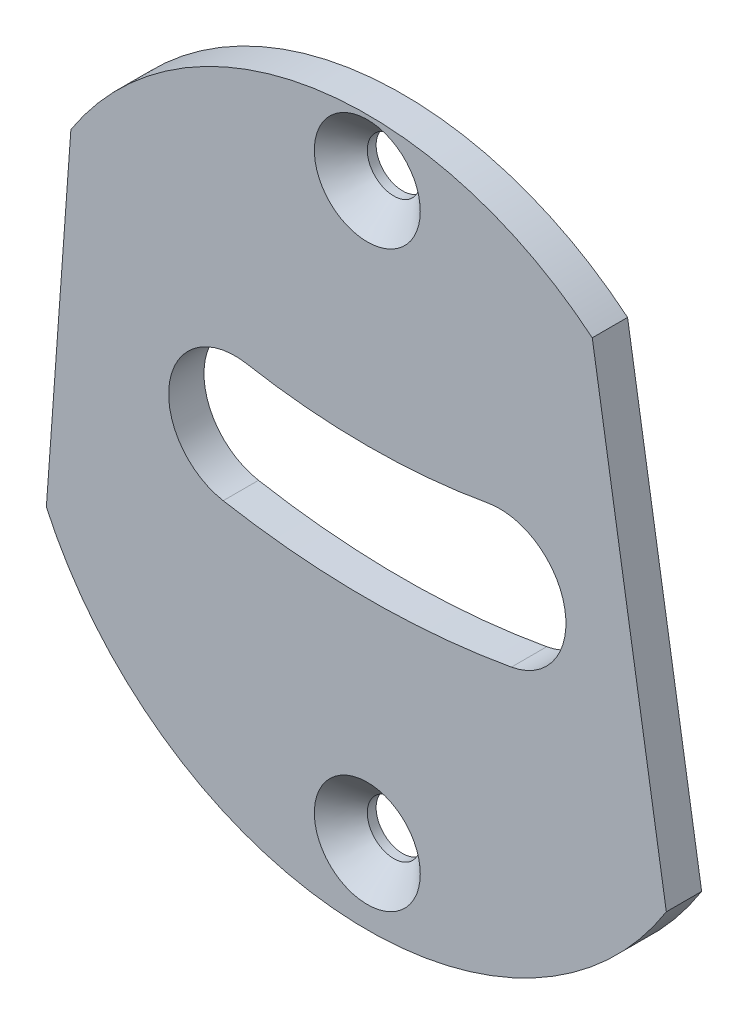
from build123d import *

# Parameters (mm, degrees)
ESQUISSE1_R      = 3
EXTRUSION1_DEPTH = 4
CHANFREIN3_SIZE  = 3


with BuildPart() as part:
    # Esquisse1 → Extrusion1 (new body)
    with BuildSketch(Plane.XY):
        with BuildLine():
            Line((-32.575111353, 1.741938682), (-35.354274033, -36.684326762))
            ThreePointArc((-35.354274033, -36.684326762), (-1.610362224, -59.914734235), (34.871661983, -41.276994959))
            Line((34.871661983, -41.276994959), (26.480535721, 10.834109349))
            ThreePointArc((26.480535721, 10.834109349), (-5.086660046, 19.534194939), (-32.575111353, 1.741938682))
        make_face()
        with Locations((1, 13.5)):
            Circle(ESQUISSE1_R, mode=Mode.SUBTRACT)
        with Locations((1, -51.5)):
            Circle(ESQUISSE1_R, mode=Mode.SUBTRACT)
        with BuildLine():
            ThreePointArc((-12.676470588, -11.283708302), (1, -12.5), (14.676470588, -11.283708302))
            ThreePointArc((14.676470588, -11.283708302), (23.382294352, -17.342473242), (17.323529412, -26.048297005))
            ThreePointArc((17.323529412, -26.048297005), (1, -27.5), (-15.323529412, -26.048297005))
            ThreePointArc((-15.323529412, -26.048297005), (-21.382294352, -17.342473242), (-12.676470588, -11.283708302))
        make_face(mode=Mode.SUBTRACT)
    extrude(amount=EXTRUSION1_DEPTH)

    # Chanfrein3
    chanfrein3_edges = [part.edges().sort_by_distance(p)[0] for p in [
        (-2, 13.5, 4),
        (-2, -51.5, 4),
    ]]
    chamfer(chanfrein3_edges, length=CHANFREIN3_SIZE)


solid = part.part
